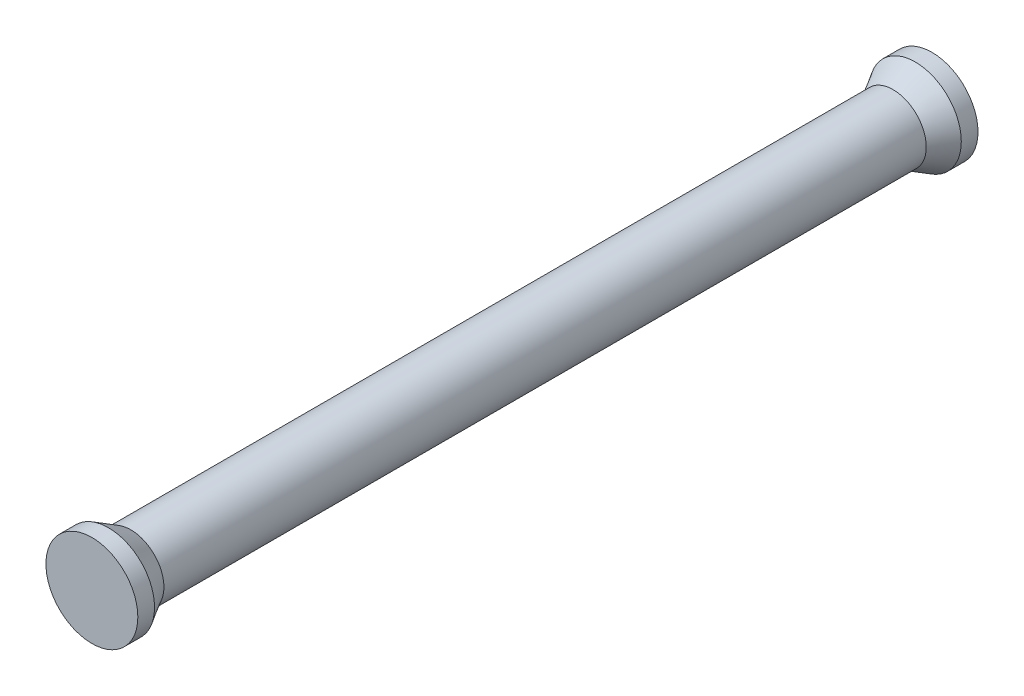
ISO-10303-21;
HEADER;
FILE_DESCRIPTION(('STEP AP214'),'2;1');
FILE_NAME('part.step','',(''),(''),'','','');
FILE_SCHEMA(('AUTOMOTIVE_DESIGN { 1 0 10303 214 1 1 1 1 }'));
ENDSEC;
DATA;
#1=APPLICATION_CONTEXT('core data for automotive mechanical design processes');
#2=APPLICATION_PROTOCOL_DEFINITION('international standard','automotive_design',2000,#1);
#3=PRODUCT_CONTEXT('',#1,'mechanical');
#4=PRODUCT('Part','Part','',(#3));
#5=PRODUCT_RELATED_PRODUCT_CATEGORY('part','',(#4));
#6=PRODUCT_DEFINITION_FORMATION('','',#4);
#7=PRODUCT_DEFINITION_CONTEXT('part definition',#1,'design');
#8=PRODUCT_DEFINITION('design','',#6,#7);
#9=PRODUCT_DEFINITION_SHAPE('','',#8);
#10=(LENGTH_UNIT() NAMED_UNIT(*) SI_UNIT(.MILLI.,.METRE.));
#11=(NAMED_UNIT(*) PLANE_ANGLE_UNIT() SI_UNIT($,.RADIAN.));
#12=(NAMED_UNIT(*) SI_UNIT($,.STERADIAN.) SOLID_ANGLE_UNIT());
#13=UNCERTAINTY_MEASURE_WITH_UNIT(LENGTH_MEASURE(1.E-05),#10,'distance_accuracy_value','');
#14=(GEOMETRIC_REPRESENTATION_CONTEXT(3) GLOBAL_UNCERTAINTY_ASSIGNED_CONTEXT((#13)) GLOBAL_UNIT_ASSIGNED_CONTEXT((#10,
#11,#12)) REPRESENTATION_CONTEXT('',''));
#15=CARTESIAN_POINT('',(0.,0.,0.));
#16=DIRECTION('',(0.,0.,1.));
#17=DIRECTION('',(1.,0.,0.));
#18=AXIS2_PLACEMENT_3D('',#15,#16,#17);
#19=CARTESIAN_POINT('',(0.,3.27659999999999,0.));
#20=DIRECTION('',(0.,0.,-1.));
#21=DIRECTION('',(-1.,0.,0.));
#22=AXIS2_PLACEMENT_3D('',#19,#20,#21);
#23=PLANE('',#22);
#24=CARTESIAN_POINT('',(0.,0.,0.));
#25=DIRECTION('',(0.,0.,1.));
#26=DIRECTION('',(1.,0.,0.));
#27=AXIS2_PLACEMENT_3D('',#24,#25,#26);
#28=CIRCLE('',#27,3.27659999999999);
#29=CARTESIAN_POINT('',(3.27659999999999,0.,0.));
#30=VERTEX_POINT('',#29);
#31=EDGE_CURVE('E57',#30,#30,#28,.T.);
#32=ORIENTED_EDGE('',*,*,#31,.T.);
#33=EDGE_LOOP('',(#32));
#34=FACE_BOUND('',#33,.T.);
#35=ADVANCED_FACE('F35',(#34),#23,.F.);
#36=CARTESIAN_POINT('',(0.,0.,-59.8932));
#37=DIRECTION('',(0.,0.,1.));
#38=DIRECTION('',(1.,0.,0.));
#39=AXIS2_PLACEMENT_3D('',#36,#37,#38);
#40=PLANE('',#39);
#41=CARTESIAN_POINT('',(0.,0.,-59.8932));
#42=DIRECTION('',(0.,0.,1.));
#43=DIRECTION('',(1.,0.,0.));
#44=AXIS2_PLACEMENT_3D('',#41,#42,#43);
#45=CIRCLE('',#44,3.2766);
#46=CARTESIAN_POINT('',(3.2766,0.,-59.8932));
#47=VERTEX_POINT('',#46);
#48=EDGE_CURVE('E10',#47,#47,#45,.T.);
#49=ORIENTED_EDGE('',*,*,#48,.F.);
#50=EDGE_LOOP('',(#49));
#51=FACE_BOUND('',#50,.T.);
#52=ADVANCED_FACE('F87',(#51),#40,.F.);
#53=CARTESIAN_POINT('',(0.,0.,0.));
#54=DIRECTION('',(0.,0.,1.));
#55=DIRECTION('',(1.,0.,0.));
#56=AXIS2_PLACEMENT_3D('',#53,#54,#55);
#57=CYLINDRICAL_SURFACE('',#56,3.2766);
#58=CARTESIAN_POINT('',(0.,0.,-58.702575));
#59=DIRECTION('',(0.,0.,1.));
#60=DIRECTION('',(1.,0.,0.));
#61=AXIS2_PLACEMENT_3D('',#58,#59,#60);
#62=CIRCLE('',#61,3.2766);
#63=CARTESIAN_POINT('',(3.2766,0.,-58.702575));
#64=VERTEX_POINT('',#63);
#65=EDGE_CURVE('E41',#64,#64,#62,.T.);
#66=ORIENTED_EDGE('',*,*,#65,.F.);
#67=EDGE_LOOP('',(#66));
#68=FACE_BOUND('',#67,.T.);
#69=ORIENTED_EDGE('',*,*,#48,.T.);
#70=EDGE_LOOP('',(#69));
#71=FACE_BOUND('',#70,.T.);
#72=ADVANCED_FACE('F82',(#68,#71),#57,.T.);
#73=CARTESIAN_POINT('',(0.,0.,-58.702575));
#74=DIRECTION('',(0.,0.,-1.));
#75=DIRECTION('',(-1.,0.,0.));
#76=AXIS2_PLACEMENT_3D('',#73,#74,#75);
#77=CONICAL_SURFACE('',#76,3.2766,0.523598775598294);
#78=CARTESIAN_POINT('',(0.,0.,-57.118787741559));
#79=DIRECTION('',(0.,0.,1.));
#80=DIRECTION('',(1.,0.,0.));
#81=AXIS2_PLACEMENT_3D('',#78,#79,#80);
#82=CIRCLE('',#81,2.3622);
#83=CARTESIAN_POINT('',(2.3622,0.,-57.118787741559));
#84=VERTEX_POINT('',#83);
#85=EDGE_CURVE('E45',#84,#84,#82,.T.);
#86=ORIENTED_EDGE('',*,*,#85,.F.);
#87=EDGE_LOOP('',(#86));
#88=FACE_BOUND('',#87,.T.);
#89=ORIENTED_EDGE('',*,*,#65,.T.);
#90=EDGE_LOOP('',(#89));
#91=FACE_BOUND('',#90,.T.);
#92=ADVANCED_FACE('F77',(#88,#91),#77,.T.);
#93=CARTESIAN_POINT('',(0.,0.,0.));
#94=DIRECTION('',(0.,0.,1.));
#95=DIRECTION('',(1.,0.,0.));
#96=AXIS2_PLACEMENT_3D('',#93,#94,#95);
#97=CYLINDRICAL_SURFACE('',#96,2.3622);
#98=CARTESIAN_POINT('',(0.,0.,-2.774412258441));
#99=DIRECTION('',(0.,0.,1.));
#100=DIRECTION('',(1.,0.,0.));
#101=AXIS2_PLACEMENT_3D('',#98,#99,#100);
#102=CIRCLE('',#101,2.36219999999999);
#103=CARTESIAN_POINT('',(2.36219999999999,0.,-2.774412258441));
#104=VERTEX_POINT('',#103);
#105=EDGE_CURVE('E49',#104,#104,#102,.T.);
#106=ORIENTED_EDGE('',*,*,#105,.F.);
#107=EDGE_LOOP('',(#106));
#108=FACE_BOUND('',#107,.T.);
#109=ORIENTED_EDGE('',*,*,#85,.T.);
#110=EDGE_LOOP('',(#109));
#111=FACE_BOUND('',#110,.T.);
#112=ADVANCED_FACE('F71',(#108,#111),#97,.T.);
#113=CARTESIAN_POINT('',(0.,0.,-2.774412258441));
#114=DIRECTION('',(0.,0.,1.));
#115=DIRECTION('',(1.,0.,0.));
#116=AXIS2_PLACEMENT_3D('',#113,#114,#115);
#117=CONICAL_SURFACE('',#116,2.36219999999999,0.523598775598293);
#118=CARTESIAN_POINT('',(0.,0.,-1.190625));
#119=DIRECTION('',(0.,0.,1.));
#120=DIRECTION('',(1.,0.,0.));
#121=AXIS2_PLACEMENT_3D('',#118,#119,#120);
#122=CIRCLE('',#121,3.27659999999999);
#123=CARTESIAN_POINT('',(3.27659999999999,0.,-1.190625));
#124=VERTEX_POINT('',#123);
#125=EDGE_CURVE('E54',#124,#124,#122,.T.);
#126=ORIENTED_EDGE('',*,*,#125,.F.);
#127=EDGE_LOOP('',(#126));
#128=FACE_BOUND('',#127,.T.);
#129=ORIENTED_EDGE('',*,*,#105,.T.);
#130=EDGE_LOOP('',(#129));
#131=FACE_BOUND('',#130,.T.);
#132=ADVANCED_FACE('F65',(#128,#131),#117,.T.);
#133=CARTESIAN_POINT('',(0.,0.,0.));
#134=DIRECTION('',(0.,0.,1.));
#135=DIRECTION('',(1.,0.,0.));
#136=AXIS2_PLACEMENT_3D('',#133,#134,#135);
#137=CYLINDRICAL_SURFACE('',#136,3.27659999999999);
#138=ORIENTED_EDGE('',*,*,#31,.F.);
#139=EDGE_LOOP('',(#138));
#140=FACE_BOUND('',#139,.T.);
#141=ORIENTED_EDGE('',*,*,#125,.T.);
#142=EDGE_LOOP('',(#141));
#143=FACE_BOUND('',#142,.T.);
#144=ADVANCED_FACE('F62',(#140,#143),#137,.T.);
#145=CLOSED_SHELL('',(#35,#52,#72,#92,#112,#132,#144));
#146=MANIFOLD_SOLID_BREP('B2',#145);
#147=ADVANCED_BREP_SHAPE_REPRESENTATION('',(#18,#146),#14);
#148=SHAPE_DEFINITION_REPRESENTATION(#9,#147);
ENDSEC;
END-ISO-10303-21;
